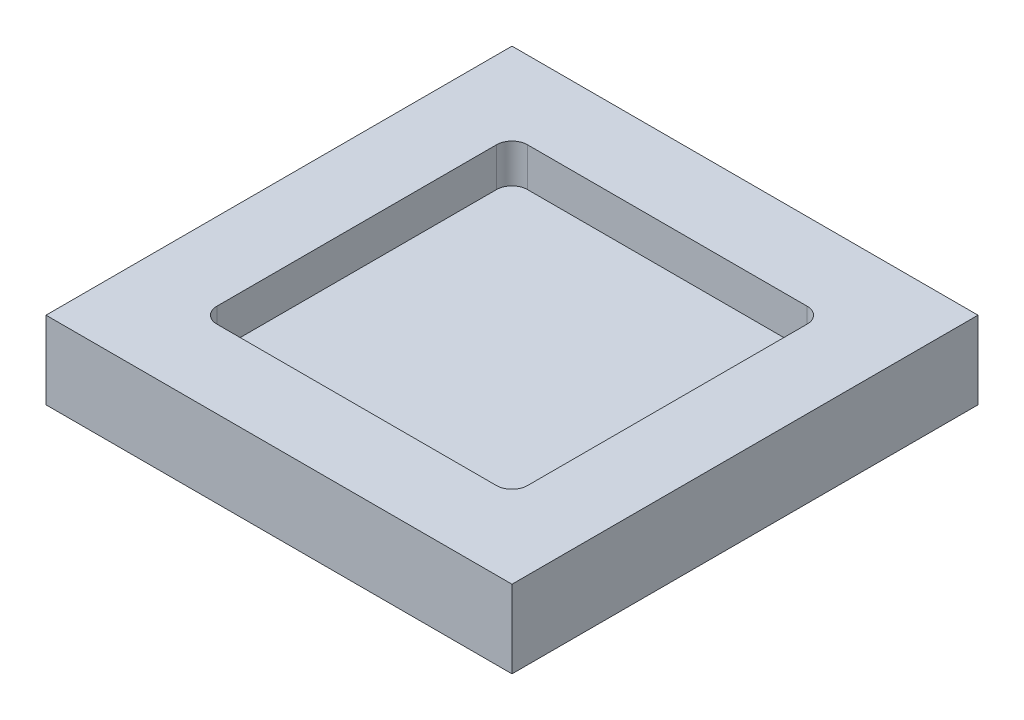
ISO-10303-21;
HEADER;
FILE_DESCRIPTION(('STEP AP214'),'2;1');
FILE_NAME('part.step','',(''),(''),'','','');
FILE_SCHEMA(('AUTOMOTIVE_DESIGN { 1 0 10303 214 1 1 1 1 }'));
ENDSEC;
DATA;
#1=APPLICATION_CONTEXT('core data for automotive mechanical design processes');
#2=APPLICATION_PROTOCOL_DEFINITION('international standard','automotive_design',2000,#1);
#3=PRODUCT_CONTEXT('',#1,'mechanical');
#4=PRODUCT('Part','Part','',(#3));
#5=PRODUCT_RELATED_PRODUCT_CATEGORY('part','',(#4));
#6=PRODUCT_DEFINITION_FORMATION('','',#4);
#7=PRODUCT_DEFINITION_CONTEXT('part definition',#1,'design');
#8=PRODUCT_DEFINITION('design','',#6,#7);
#9=PRODUCT_DEFINITION_SHAPE('','',#8);
#10=(LENGTH_UNIT() NAMED_UNIT(*) SI_UNIT(.MILLI.,.METRE.));
#11=(NAMED_UNIT(*) PLANE_ANGLE_UNIT() SI_UNIT($,.RADIAN.));
#12=(NAMED_UNIT(*) SI_UNIT($,.STERADIAN.) SOLID_ANGLE_UNIT());
#13=UNCERTAINTY_MEASURE_WITH_UNIT(LENGTH_MEASURE(1.E-05),#10,'distance_accuracy_value','');
#14=(GEOMETRIC_REPRESENTATION_CONTEXT(3) GLOBAL_UNCERTAINTY_ASSIGNED_CONTEXT((#13)) GLOBAL_UNIT_ASSIGNED_CONTEXT((#10,
#11,#12)) REPRESENTATION_CONTEXT('',''));
#15=CARTESIAN_POINT('',(0.,0.,0.));
#16=DIRECTION('',(0.,0.,1.));
#17=DIRECTION('',(1.,0.,0.));
#18=AXIS2_PLACEMENT_3D('',#15,#16,#17);
#19=CARTESIAN_POINT('',(-38.1,12.7,-38.1));
#20=DIRECTION('',(1.,0.,0.));
#21=DIRECTION('',(0.,0.,-1.));
#22=AXIS2_PLACEMENT_3D('',#19,#20,#21);
#23=PLANE('',#22);
#24=DIRECTION('',(0.,0.,1.));
#25=VECTOR('',#24,1.);
#26=CARTESIAN_POINT('',(-38.1,0.,-38.1));
#27=LINE('',#26,#25);
#28=CARTESIAN_POINT('',(-38.1,0.,-38.1));
#29=VERTEX_POINT('',#28);
#30=CARTESIAN_POINT('',(-38.1,0.,38.1));
#31=VERTEX_POINT('',#30);
#32=EDGE_CURVE('E123',#29,#31,#27,.T.);
#33=ORIENTED_EDGE('',*,*,#32,.T.);
#34=DIRECTION('',(0.,-1.,0.));
#35=VECTOR('',#34,1.);
#36=CARTESIAN_POINT('',(-38.1,12.7,38.1));
#37=LINE('',#36,#35);
#38=CARTESIAN_POINT('',(-38.1,12.7,38.1));
#39=VERTEX_POINT('',#38);
#40=EDGE_CURVE('E130',#39,#31,#37,.T.);
#41=ORIENTED_EDGE('',*,*,#40,.F.);
#42=DIRECTION('',(0.,0.,1.));
#43=VECTOR('',#42,1.);
#44=CARTESIAN_POINT('',(-38.1,12.7,-38.1));
#45=LINE('',#44,#43);
#46=CARTESIAN_POINT('',(-38.1,12.7,-38.1));
#47=VERTEX_POINT('',#46);
#48=EDGE_CURVE('E152',#47,#39,#45,.T.);
#49=ORIENTED_EDGE('',*,*,#48,.F.);
#50=DIRECTION('',(0.,-1.,0.));
#51=VECTOR('',#50,1.);
#52=CARTESIAN_POINT('',(-38.1,12.7,-38.1));
#53=LINE('',#52,#51);
#54=EDGE_CURVE('E141',#47,#29,#53,.T.);
#55=ORIENTED_EDGE('',*,*,#54,.T.);
#56=EDGE_LOOP('',(#33,#41,#49,#55));
#57=FACE_BOUND('',#56,.T.);
#58=ADVANCED_FACE('F31',(#57),#23,.F.);
#59=CARTESIAN_POINT('',(-38.1,12.7,38.1));
#60=DIRECTION('',(0.,0.,-1.));
#61=DIRECTION('',(-1.,0.,0.));
#62=AXIS2_PLACEMENT_3D('',#59,#60,#61);
#63=PLANE('',#62);
#64=DIRECTION('',(1.,0.,0.));
#65=VECTOR('',#64,1.);
#66=CARTESIAN_POINT('',(-38.1,0.,38.1));
#67=LINE('',#66,#65);
#68=CARTESIAN_POINT('',(38.1,0.,38.1));
#69=VERTEX_POINT('',#68);
#70=EDGE_CURVE('E118',#31,#69,#67,.T.);
#71=ORIENTED_EDGE('',*,*,#70,.T.);
#72=DIRECTION('',(0.,-1.,0.));
#73=VECTOR('',#72,1.);
#74=CARTESIAN_POINT('',(38.1,12.7,38.1));
#75=LINE('',#74,#73);
#76=CARTESIAN_POINT('',(38.1,12.7,38.1));
#77=VERTEX_POINT('',#76);
#78=EDGE_CURVE('E137',#77,#69,#75,.T.);
#79=ORIENTED_EDGE('',*,*,#78,.F.);
#80=DIRECTION('',(1.,0.,0.));
#81=VECTOR('',#80,1.);
#82=CARTESIAN_POINT('',(-38.1,12.7,38.1));
#83=LINE('',#82,#81);
#84=EDGE_CURVE('E132',#39,#77,#83,.T.);
#85=ORIENTED_EDGE('',*,*,#84,.F.);
#86=ORIENTED_EDGE('',*,*,#40,.T.);
#87=EDGE_LOOP('',(#71,#79,#85,#86));
#88=FACE_BOUND('',#87,.T.);
#89=ADVANCED_FACE('F131',(#88),#63,.F.);
#90=CARTESIAN_POINT('',(38.1,12.7,-38.1));
#91=DIRECTION('',(-1.,0.,0.));
#92=DIRECTION('',(0.,0.,1.));
#93=AXIS2_PLACEMENT_3D('',#90,#91,#92);
#94=PLANE('',#93);
#95=DIRECTION('',(0.,0.,-1.));
#96=VECTOR('',#95,1.);
#97=CARTESIAN_POINT('',(38.1,0.,-38.1));
#98=LINE('',#97,#96);
#99=CARTESIAN_POINT('',(38.1,0.,-38.1));
#100=VERTEX_POINT('',#99);
#101=EDGE_CURVE('E124',#69,#100,#98,.T.);
#102=ORIENTED_EDGE('',*,*,#101,.T.);
#103=DIRECTION('',(0.,-1.,0.));
#104=VECTOR('',#103,1.);
#105=CARTESIAN_POINT('',(38.1,12.7,-38.1));
#106=LINE('',#105,#104);
#107=CARTESIAN_POINT('',(38.1,12.7,-38.1));
#108=VERTEX_POINT('',#107);
#109=EDGE_CURVE('E160',#108,#100,#106,.T.);
#110=ORIENTED_EDGE('',*,*,#109,.F.);
#111=DIRECTION('',(0.,0.,-1.));
#112=VECTOR('',#111,1.);
#113=CARTESIAN_POINT('',(38.1,12.7,-38.1));
#114=LINE('',#113,#112);
#115=EDGE_CURVE('E155',#77,#108,#114,.T.);
#116=ORIENTED_EDGE('',*,*,#115,.F.);
#117=ORIENTED_EDGE('',*,*,#78,.T.);
#118=EDGE_LOOP('',(#102,#110,#116,#117));
#119=FACE_BOUND('',#118,.T.);
#120=ADVANCED_FACE('F258',(#119),#94,.F.);
#121=CARTESIAN_POINT('',(-38.1,12.7,-38.1));
#122=DIRECTION('',(0.,0.,1.));
#123=DIRECTION('',(1.,0.,0.));
#124=AXIS2_PLACEMENT_3D('',#121,#122,#123);
#125=PLANE('',#124);
#126=DIRECTION('',(-1.,0.,0.));
#127=VECTOR('',#126,1.);
#128=CARTESIAN_POINT('',(-38.1,0.,-38.1));
#129=LINE('',#128,#127);
#130=EDGE_CURVE('E150',#100,#29,#129,.T.);
#131=ORIENTED_EDGE('',*,*,#130,.T.);
#132=ORIENTED_EDGE('',*,*,#54,.F.);
#133=DIRECTION('',(-1.,0.,0.));
#134=VECTOR('',#133,1.);
#135=CARTESIAN_POINT('',(-38.1,12.7,-38.1));
#136=LINE('',#135,#134);
#137=EDGE_CURVE('E157',#108,#47,#136,.T.);
#138=ORIENTED_EDGE('',*,*,#137,.F.);
#139=ORIENTED_EDGE('',*,*,#109,.T.);
#140=EDGE_LOOP('',(#131,#132,#138,#139));
#141=FACE_BOUND('',#140,.T.);
#142=ADVANCED_FACE('F262',(#141),#125,.F.);
#143=CARTESIAN_POINT('',(-38.1,12.7,38.1));
#144=DIRECTION('',(0.,1.,0.));
#145=DIRECTION('',(0.,0.,1.));
#146=AXIS2_PLACEMENT_3D('',#143,#144,#145);
#147=PLANE('',#146);
#148=DIRECTION('',(0.,0.,1.));
#149=VECTOR('',#148,1.);
#150=CARTESIAN_POINT('',(-25.4,12.7,-25.4));
#151=LINE('',#150,#149);
#152=CARTESIAN_POINT('',(-25.4,12.7,-22.86));
#153=VERTEX_POINT('',#152);
#154=CARTESIAN_POINT('',(-25.4,12.7,22.86));
#155=VERTEX_POINT('',#154);
#156=EDGE_CURVE('E208',#153,#155,#151,.T.);
#157=ORIENTED_EDGE('',*,*,#156,.F.);
#158=CARTESIAN_POINT('',(-22.86,12.7,-22.86));
#159=DIRECTION('',(0.,1.,0.));
#160=DIRECTION('',(0.,0.,1.));
#161=AXIS2_PLACEMENT_3D('',#158,#159,#160);
#162=CIRCLE('',#161,2.54);
#163=CARTESIAN_POINT('',(-22.86,12.7,-25.4));
#164=VERTEX_POINT('',#163);
#165=EDGE_CURVE('E11',#153,#164,#162,.F.);
#166=ORIENTED_EDGE('',*,*,#165,.T.);
#167=DIRECTION('',(-1.,0.,0.));
#168=VECTOR('',#167,1.);
#169=CARTESIAN_POINT('',(-25.4,12.7,-25.4));
#170=LINE('',#169,#168);
#171=CARTESIAN_POINT('',(22.86,12.7,-25.4));
#172=VERTEX_POINT('',#171);
#173=EDGE_CURVE('E226',#172,#164,#170,.T.);
#174=ORIENTED_EDGE('',*,*,#173,.F.);
#175=CARTESIAN_POINT('',(22.86,12.7,-22.86));
#176=DIRECTION('',(0.,1.,0.));
#177=DIRECTION('',(0.,0.,1.));
#178=AXIS2_PLACEMENT_3D('',#175,#176,#177);
#179=CIRCLE('',#178,2.54);
#180=CARTESIAN_POINT('',(25.4,12.7,-22.86));
#181=VERTEX_POINT('',#180);
#182=EDGE_CURVE('E190',#172,#181,#179,.F.);
#183=ORIENTED_EDGE('',*,*,#182,.T.);
#184=DIRECTION('',(0.,0.,-1.));
#185=VECTOR('',#184,1.);
#186=CARTESIAN_POINT('',(25.4,12.7,-25.4));
#187=LINE('',#186,#185);
#188=CARTESIAN_POINT('',(25.4,12.7,22.86));
#189=VERTEX_POINT('',#188);
#190=EDGE_CURVE('E199',#189,#181,#187,.T.);
#191=ORIENTED_EDGE('',*,*,#190,.F.);
#192=CARTESIAN_POINT('',(22.86,12.7,22.86));
#193=DIRECTION('',(0.,1.,0.));
#194=DIRECTION('',(0.,0.,1.));
#195=AXIS2_PLACEMENT_3D('',#192,#193,#194);
#196=CIRCLE('',#195,2.54);
#197=CARTESIAN_POINT('',(22.86,12.7,25.4));
#198=VERTEX_POINT('',#197);
#199=EDGE_CURVE('E192',#189,#198,#196,.F.);
#200=ORIENTED_EDGE('',*,*,#199,.T.);
#201=DIRECTION('',(1.,0.,0.));
#202=VECTOR('',#201,1.);
#203=CARTESIAN_POINT('',(-25.4,12.7,25.4));
#204=LINE('',#203,#202);
#205=CARTESIAN_POINT('',(-22.86,12.7,25.4));
#206=VERTEX_POINT('',#205);
#207=EDGE_CURVE('E197',#206,#198,#204,.T.);
#208=ORIENTED_EDGE('',*,*,#207,.F.);
#209=CARTESIAN_POINT('',(-22.86,12.7,22.86));
#210=DIRECTION('',(0.,1.,0.));
#211=DIRECTION('',(0.,0.,1.));
#212=AXIS2_PLACEMENT_3D('',#209,#210,#211);
#213=CIRCLE('',#212,2.54);
#214=EDGE_CURVE('E38',#206,#155,#213,.F.);
#215=ORIENTED_EDGE('',*,*,#214,.T.);
#216=EDGE_LOOP('',(#157,#166,#174,#183,#191,#200,#208,#215));
#217=FACE_BOUND('',#216,.T.);
#218=ORIENTED_EDGE('',*,*,#48,.T.);
#219=ORIENTED_EDGE('',*,*,#84,.T.);
#220=ORIENTED_EDGE('',*,*,#115,.T.);
#221=ORIENTED_EDGE('',*,*,#137,.T.);
#222=EDGE_LOOP('',(#218,#219,#220,#221));
#223=FACE_BOUND('',#222,.T.);
#224=ADVANCED_FACE('F195',(#217,#223),#147,.T.);
#225=CARTESIAN_POINT('',(-38.1,0.,38.1));
#226=DIRECTION('',(0.,1.,0.));
#227=DIRECTION('',(0.,0.,1.));
#228=AXIS2_PLACEMENT_3D('',#225,#226,#227);
#229=PLANE('',#228);
#230=ORIENTED_EDGE('',*,*,#32,.F.);
#231=ORIENTED_EDGE('',*,*,#130,.F.);
#232=ORIENTED_EDGE('',*,*,#101,.F.);
#233=ORIENTED_EDGE('',*,*,#70,.F.);
#234=EDGE_LOOP('',(#230,#231,#232,#233));
#235=FACE_BOUND('',#234,.T.);
#236=ADVANCED_FACE('F120',(#235),#229,.F.);
#237=CARTESIAN_POINT('',(-25.4,6.35,-25.4));
#238=DIRECTION('',(-1.,0.,0.));
#239=DIRECTION('',(0.,0.,1.));
#240=AXIS2_PLACEMENT_3D('',#237,#238,#239);
#241=PLANE('',#240);
#242=ORIENTED_EDGE('',*,*,#156,.T.);
#243=DIRECTION('',(0.,1.,0.));
#244=VECTOR('',#243,1.);
#245=CARTESIAN_POINT('',(-25.4,6.35,22.86));
#246=LINE('',#245,#244);
#247=CARTESIAN_POINT('',(-25.4,6.35,22.86));
#248=VERTEX_POINT('',#247);
#249=EDGE_CURVE('E188',#155,#248,#246,.F.);
#250=ORIENTED_EDGE('',*,*,#249,.T.);
#251=DIRECTION('',(0.,0.,1.));
#252=VECTOR('',#251,1.);
#253=CARTESIAN_POINT('',(-25.4,6.35,-25.4));
#254=LINE('',#253,#252);
#255=CARTESIAN_POINT('',(-25.4,6.35,-22.86));
#256=VERTEX_POINT('',#255);
#257=EDGE_CURVE('E221',#256,#248,#254,.T.);
#258=ORIENTED_EDGE('',*,*,#257,.F.);
#259=DIRECTION('',(0.,1.,0.));
#260=VECTOR('',#259,1.);
#261=CARTESIAN_POINT('',(-25.4,12.7,-22.86));
#262=LINE('',#261,#260);
#263=EDGE_CURVE('E186',#256,#153,#262,.T.);
#264=ORIENTED_EDGE('',*,*,#263,.T.);
#265=EDGE_LOOP('',(#242,#250,#258,#264));
#266=FACE_BOUND('',#265,.T.);
#267=ADVANCED_FACE('F232',(#266),#241,.F.);
#268=CARTESIAN_POINT('',(-25.4,6.35,-25.4));
#269=DIRECTION('',(0.,0.,-1.));
#270=DIRECTION('',(-1.,0.,0.));
#271=AXIS2_PLACEMENT_3D('',#268,#269,#270);
#272=PLANE('',#271);
#273=DIRECTION('',(-1.,0.,0.));
#274=VECTOR('',#273,1.);
#275=CARTESIAN_POINT('',(-25.4,6.35,-25.4));
#276=LINE('',#275,#274);
#277=CARTESIAN_POINT('',(22.86,6.35,-25.4));
#278=VERTEX_POINT('',#277);
#279=CARTESIAN_POINT('',(-22.86,6.35,-25.4));
#280=VERTEX_POINT('',#279);
#281=EDGE_CURVE('E142',#278,#280,#276,.T.);
#282=ORIENTED_EDGE('',*,*,#281,.F.);
#283=DIRECTION('',(0.,1.,0.));
#284=VECTOR('',#283,1.);
#285=CARTESIAN_POINT('',(22.86,12.7,-25.4));
#286=LINE('',#285,#284);
#287=EDGE_CURVE('E165',#278,#172,#286,.T.);
#288=ORIENTED_EDGE('',*,*,#287,.T.);
#289=ORIENTED_EDGE('',*,*,#173,.T.);
#290=DIRECTION('',(0.,1.,0.));
#291=VECTOR('',#290,1.);
#292=CARTESIAN_POINT('',(-22.86,6.35,-25.4));
#293=LINE('',#292,#291);
#294=EDGE_CURVE('E136',#164,#280,#293,.F.);
#295=ORIENTED_EDGE('',*,*,#294,.T.);
#296=EDGE_LOOP('',(#282,#288,#289,#295));
#297=FACE_BOUND('',#296,.T.);
#298=ADVANCED_FACE('F241',(#297),#272,.F.);
#299=CARTESIAN_POINT('',(25.4,6.35,-25.4));
#300=DIRECTION('',(1.,0.,0.));
#301=DIRECTION('',(0.,0.,-1.));
#302=AXIS2_PLACEMENT_3D('',#299,#300,#301);
#303=PLANE('',#302);
#304=ORIENTED_EDGE('',*,*,#190,.T.);
#305=DIRECTION('',(0.,1.,0.));
#306=VECTOR('',#305,1.);
#307=CARTESIAN_POINT('',(25.4,6.35,-22.86));
#308=LINE('',#307,#306);
#309=CARTESIAN_POINT('',(25.4,6.35,-22.86));
#310=VERTEX_POINT('',#309);
#311=EDGE_CURVE('E171',#181,#310,#308,.F.);
#312=ORIENTED_EDGE('',*,*,#311,.T.);
#313=DIRECTION('',(0.,0.,-1.));
#314=VECTOR('',#313,1.);
#315=CARTESIAN_POINT('',(25.4,6.35,-25.4));
#316=LINE('',#315,#314);
#317=CARTESIAN_POINT('',(25.4,6.35,22.86));
#318=VERTEX_POINT('',#317);
#319=EDGE_CURVE('E145',#318,#310,#316,.T.);
#320=ORIENTED_EDGE('',*,*,#319,.F.);
#321=DIRECTION('',(0.,1.,0.));
#322=VECTOR('',#321,1.);
#323=CARTESIAN_POINT('',(25.4,12.7,22.86));
#324=LINE('',#323,#322);
#325=EDGE_CURVE('E168',#318,#189,#324,.T.);
#326=ORIENTED_EDGE('',*,*,#325,.T.);
#327=EDGE_LOOP('',(#304,#312,#320,#326));
#328=FACE_BOUND('',#327,.T.);
#329=ADVANCED_FACE('F219',(#328),#303,.F.);
#330=CARTESIAN_POINT('',(-25.4,6.35,25.4));
#331=DIRECTION('',(0.,0.,1.));
#332=DIRECTION('',(1.,0.,0.));
#333=AXIS2_PLACEMENT_3D('',#330,#331,#332);
#334=PLANE('',#333);
#335=ORIENTED_EDGE('',*,*,#207,.T.);
#336=DIRECTION('',(0.,1.,0.));
#337=VECTOR('',#336,1.);
#338=CARTESIAN_POINT('',(22.86,6.35,25.4));
#339=LINE('',#338,#337);
#340=CARTESIAN_POINT('',(22.86,6.35,25.4));
#341=VERTEX_POINT('',#340);
#342=EDGE_CURVE('E184',#198,#341,#339,.F.);
#343=ORIENTED_EDGE('',*,*,#342,.T.);
#344=DIRECTION('',(1.,0.,0.));
#345=VECTOR('',#344,1.);
#346=CARTESIAN_POINT('',(-25.4,6.35,25.4));
#347=LINE('',#346,#345);
#348=CARTESIAN_POINT('',(-22.86,6.35,25.4));
#349=VERTEX_POINT('',#348);
#350=EDGE_CURVE('E217',#349,#341,#347,.T.);
#351=ORIENTED_EDGE('',*,*,#350,.F.);
#352=DIRECTION('',(0.,1.,0.));
#353=VECTOR('',#352,1.);
#354=CARTESIAN_POINT('',(-22.86,12.7,25.4));
#355=LINE('',#354,#353);
#356=EDGE_CURVE('E181',#349,#206,#355,.T.);
#357=ORIENTED_EDGE('',*,*,#356,.T.);
#358=EDGE_LOOP('',(#335,#343,#351,#357));
#359=FACE_BOUND('',#358,.T.);
#360=ADVANCED_FACE('F204',(#359),#334,.F.);
#361=CARTESIAN_POINT('',(-25.4,6.35,25.4));
#362=DIRECTION('',(0.,1.,0.));
#363=DIRECTION('',(0.,0.,1.));
#364=AXIS2_PLACEMENT_3D('',#361,#362,#363);
#365=PLANE('',#364);
#366=ORIENTED_EDGE('',*,*,#319,.T.);
#367=CARTESIAN_POINT('',(22.86,6.35,-22.86));
#368=DIRECTION('',(0.,1.,0.));
#369=DIRECTION('',(0.,0.,1.));
#370=AXIS2_PLACEMENT_3D('',#367,#368,#369);
#371=CIRCLE('',#370,2.54);
#372=EDGE_CURVE('E179',#310,#278,#371,.T.);
#373=ORIENTED_EDGE('',*,*,#372,.T.);
#374=ORIENTED_EDGE('',*,*,#281,.T.);
#375=CARTESIAN_POINT('',(-22.86,6.35,-22.86));
#376=DIRECTION('',(0.,1.,0.));
#377=DIRECTION('',(0.,0.,1.));
#378=AXIS2_PLACEMENT_3D('',#375,#376,#377);
#379=CIRCLE('',#378,2.54);
#380=EDGE_CURVE('E173',#280,#256,#379,.T.);
#381=ORIENTED_EDGE('',*,*,#380,.T.);
#382=ORIENTED_EDGE('',*,*,#257,.T.);
#383=CARTESIAN_POINT('',(-22.86,6.35,22.86));
#384=DIRECTION('',(0.,1.,0.));
#385=DIRECTION('',(0.,0.,1.));
#386=AXIS2_PLACEMENT_3D('',#383,#384,#385);
#387=CIRCLE('',#386,2.54);
#388=EDGE_CURVE('E175',#248,#349,#387,.T.);
#389=ORIENTED_EDGE('',*,*,#388,.T.);
#390=ORIENTED_EDGE('',*,*,#350,.T.);
#391=CARTESIAN_POINT('',(22.86,6.35,22.86));
#392=DIRECTION('',(0.,1.,0.));
#393=DIRECTION('',(0.,0.,1.));
#394=AXIS2_PLACEMENT_3D('',#391,#392,#393);
#395=CIRCLE('',#394,2.54);
#396=EDGE_CURVE('E177',#341,#318,#395,.T.);
#397=ORIENTED_EDGE('',*,*,#396,.T.);
#398=EDGE_LOOP('',(#366,#373,#374,#381,#382,#389,#390,#397));
#399=FACE_BOUND('',#398,.T.);
#400=ADVANCED_FACE('F215',(#399),#365,.T.);
#401=CARTESIAN_POINT('',(22.86,6.35,-22.86));
#402=DIRECTION('',(0.,-1.,0.));
#403=DIRECTION('',(0.,0.,-1.));
#404=AXIS2_PLACEMENT_3D('',#401,#402,#403);
#405=CYLINDRICAL_SURFACE('',#404,2.54);
#406=ORIENTED_EDGE('',*,*,#372,.F.);
#407=ORIENTED_EDGE('',*,*,#311,.F.);
#408=ORIENTED_EDGE('',*,*,#182,.F.);
#409=ORIENTED_EDGE('',*,*,#287,.F.);
#410=EDGE_LOOP('',(#406,#407,#408,#409));
#411=FACE_BOUND('',#410,.T.);
#412=ADVANCED_FACE('F245',(#411),#405,.F.);
#413=CARTESIAN_POINT('',(22.86,6.35,22.86));
#414=DIRECTION('',(0.,-1.,0.));
#415=DIRECTION('',(0.,0.,-1.));
#416=AXIS2_PLACEMENT_3D('',#413,#414,#415);
#417=CYLINDRICAL_SURFACE('',#416,2.54);
#418=ORIENTED_EDGE('',*,*,#396,.F.);
#419=ORIENTED_EDGE('',*,*,#342,.F.);
#420=ORIENTED_EDGE('',*,*,#199,.F.);
#421=ORIENTED_EDGE('',*,*,#325,.F.);
#422=EDGE_LOOP('',(#418,#419,#420,#421));
#423=FACE_BOUND('',#422,.T.);
#424=ADVANCED_FACE('F211',(#423),#417,.F.);
#425=CARTESIAN_POINT('',(-22.86,6.35,22.86));
#426=DIRECTION('',(0.,-1.,0.));
#427=DIRECTION('',(0.,0.,-1.));
#428=AXIS2_PLACEMENT_3D('',#425,#426,#427);
#429=CYLINDRICAL_SURFACE('',#428,2.54);
#430=ORIENTED_EDGE('',*,*,#388,.F.);
#431=ORIENTED_EDGE('',*,*,#249,.F.);
#432=ORIENTED_EDGE('',*,*,#214,.F.);
#433=ORIENTED_EDGE('',*,*,#356,.F.);
#434=EDGE_LOOP('',(#430,#431,#432,#433));
#435=FACE_BOUND('',#434,.T.);
#436=ADVANCED_FACE('F236',(#435),#429,.F.);
#437=CARTESIAN_POINT('',(-22.86,6.35,-22.86));
#438=DIRECTION('',(0.,-1.,0.));
#439=DIRECTION('',(0.,0.,-1.));
#440=AXIS2_PLACEMENT_3D('',#437,#438,#439);
#441=CYLINDRICAL_SURFACE('',#440,2.54);
#442=ORIENTED_EDGE('',*,*,#380,.F.);
#443=ORIENTED_EDGE('',*,*,#294,.F.);
#444=ORIENTED_EDGE('',*,*,#165,.F.);
#445=ORIENTED_EDGE('',*,*,#263,.F.);
#446=EDGE_LOOP('',(#442,#443,#444,#445));
#447=FACE_BOUND('',#446,.T.);
#448=ADVANCED_FACE('F238',(#447),#441,.F.);
#449=CLOSED_SHELL('',(#58,#89,#120,#142,#224,#236,#267,#298,#329,#360,#400,#412,#424,#436,#448));
#450=MANIFOLD_SOLID_BREP('B2',#449);
#451=ADVANCED_BREP_SHAPE_REPRESENTATION('',(#18,#450),#14);
#452=SHAPE_DEFINITION_REPRESENTATION(#9,#451);
ENDSEC;
END-ISO-10303-21;
